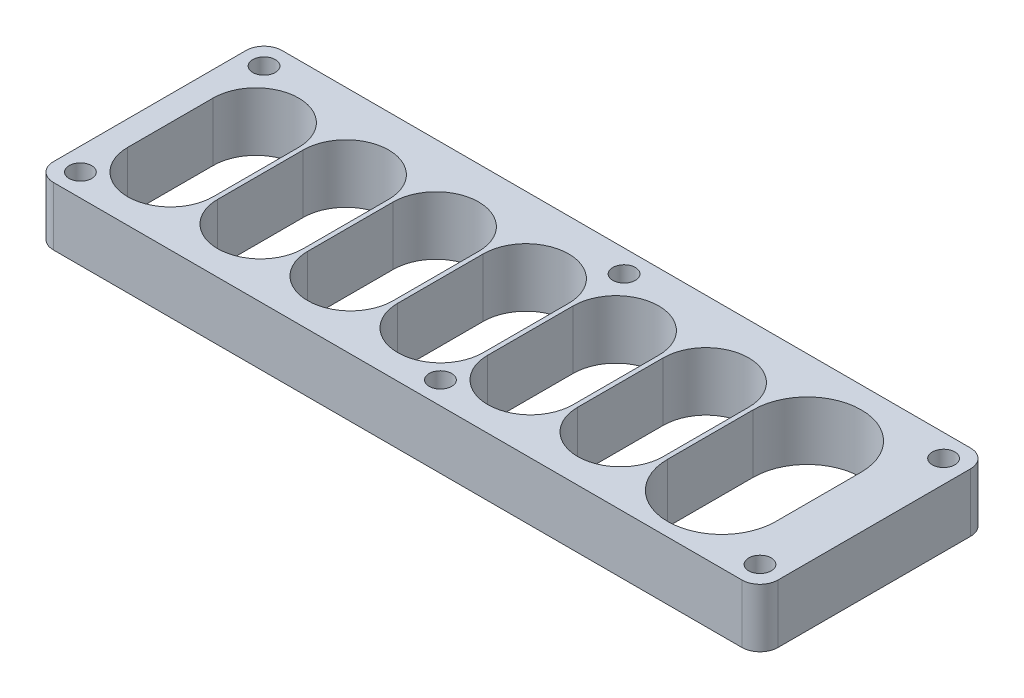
from build123d import *

# Parameters (mm, degrees)
SKETCH1_W                    = 161
SKETCH1_H                    = 50.8
BOSS_EXTRUDE1_DEPTH          = 13
CUT_EXTRUDE1_DEPTH           = 170.324067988
FILLET1_R                    = 4
F_5_0MM_DOWEL_HOLE1_D        = 5
F_9_0_9_DIAMETER_HOLE1_D     = 9
F_9_0_9_DIAMETER_HOLE1_DEPTH = 5
F_9_0_9_DIAMETER_HOLE1_TIP   = 2.703872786


with BuildPart() as part:
    # Sketch1 → Boss-Extrude1 (new body)
    with BuildSketch(Plane(origin=(0, 0, 0), x_dir=(1, 0, 0), z_dir=(0, 1, 0))):
        with Locations((-80.5, -25.4)):
            Rectangle(SKETCH1_W, SKETCH1_H)
    extrude(amount=BOSS_EXTRUDE1_DEPTH)

    # Sketch2 → Cut-Extrude1 (cut, through all)
    with BuildSketch(Plane(origin=(0, 13, 0), x_dir=(1, 0, 0), z_dir=(0, 1, 0))):
        with BuildLine():
            Line((-136.5, -16.8), (-136.5, -35.8))
            ThreePointArc((-136.5, -35.8), (-146, -45.3), (-155.5, -35.8))
            Line((-155.5, -35.8), (-155.5, -16.8))
            ThreePointArc((-155.5, -16.8), (-146, -7.3), (-136.5, -16.8))
        make_face()
        with BuildLine():
            Line((-116.5, -16.8), (-116.5, -35.8))
            ThreePointArc((-116.5, -35.8), (-126, -45.3), (-135.5, -35.8))
            Line((-135.5, -35.8), (-135.5, -16.8))
            ThreePointArc((-135.5, -16.8), (-126, -7.3), (-116.5, -16.8))
        make_face()
        with BuildLine():
            Line((-96.5, -16.8), (-96.5, -35.8))
            ThreePointArc((-96.5, -35.8), (-106, -45.3), (-115.5, -35.8))
            Line((-115.5, -35.8), (-115.5, -16.8))
            ThreePointArc((-115.5, -16.8), (-106, -7.3), (-96.5, -16.8))
        make_face()
        with BuildLine():
            Line((-76.5, -16.8), (-76.5, -35.8))
            ThreePointArc((-76.5, -35.8), (-86, -45.3), (-95.5, -35.8))
            Line((-95.5, -35.8), (-95.5, -16.8))
            ThreePointArc((-95.5, -16.8), (-86, -7.3), (-76.5, -16.8))
        make_face()
        with BuildLine():
            Line((-56.5, -16.8), (-56.5, -35.8))
            ThreePointArc((-56.5, -35.8), (-66, -45.3), (-75.5, -35.8))
            Line((-75.5, -35.8), (-75.5, -16.8))
            ThreePointArc((-75.5, -16.8), (-66, -7.3), (-56.5, -16.8))
        make_face()
        with BuildLine():
            Line((-36.5, -16.8), (-36.5, -35.8))
            ThreePointArc((-36.5, -35.8), (-46, -45.3), (-55.5, -35.8))
            Line((-55.5, -35.8), (-55.5, -16.8))
            ThreePointArc((-55.5, -16.8), (-46, -7.3), (-36.5, -16.8))
        make_face()
        with BuildLine():
            Line((-11.5, -16.8), (-11.5, -35.8))
            ThreePointArc((-11.5, -35.8), (-23.5, -47.8), (-35.5, -35.8))
            Line((-35.5, -35.8), (-35.5, -16.8))
            ThreePointArc((-35.5, -16.8), (-23.5, -4.8), (-11.5, -16.8))
        make_face()
    extrude(amount=-CUT_EXTRUDE1_DEPTH, mode=Mode.SUBTRACT)

    # Fillet1
    fillet1_edges = [part.edges().sort_by_distance(p)[0] for p in [
        (-161, 6.5, 0),
        (0, 6.5, 0),
        (0, 6.5, 50.8),
        (-161, 6.5, 50.8),
    ]]
    fillet(fillet1_edges, radius=FILLET1_R)

    # 5.0mm Dowel Hole1 (through all)
    with Locations(Plane(origin=(0, 13, 0), x_dir=(1, 0, 0), z_dir=(0, 1, 0))):
        with Locations((-156, -45.8), (-76, -45.8), (-5, -45.8), (-5, -5), (-76, -5), (-156, -5)):
            Hole(F_5_0MM_DOWEL_HOLE1_D / 2)

    # 9.0 _9_ Diameter Hole1
    with Locations(Plane(origin=(0, 0, 0), x_dir=(-1, 0, 0), z_dir=(0, -1, 0))):
        with Locations((156, -45.8), (76, -45.8), (5, -45.8), (5, -5), (76, -5), (156, -5)):
            Hole(F_9_0_9_DIAMETER_HOLE1_D / 2, depth=F_9_0_9_DIAMETER_HOLE1_DEPTH)
            with Locations((0, 0, -(F_9_0_9_DIAMETER_HOLE1_DEPTH + F_9_0_9_DIAMETER_HOLE1_TIP / 2))):  # 118° drill point
                Cone(0, F_9_0_9_DIAMETER_HOLE1_D / 2, F_9_0_9_DIAMETER_HOLE1_TIP, mode=Mode.SUBTRACT)


solid = part.part
